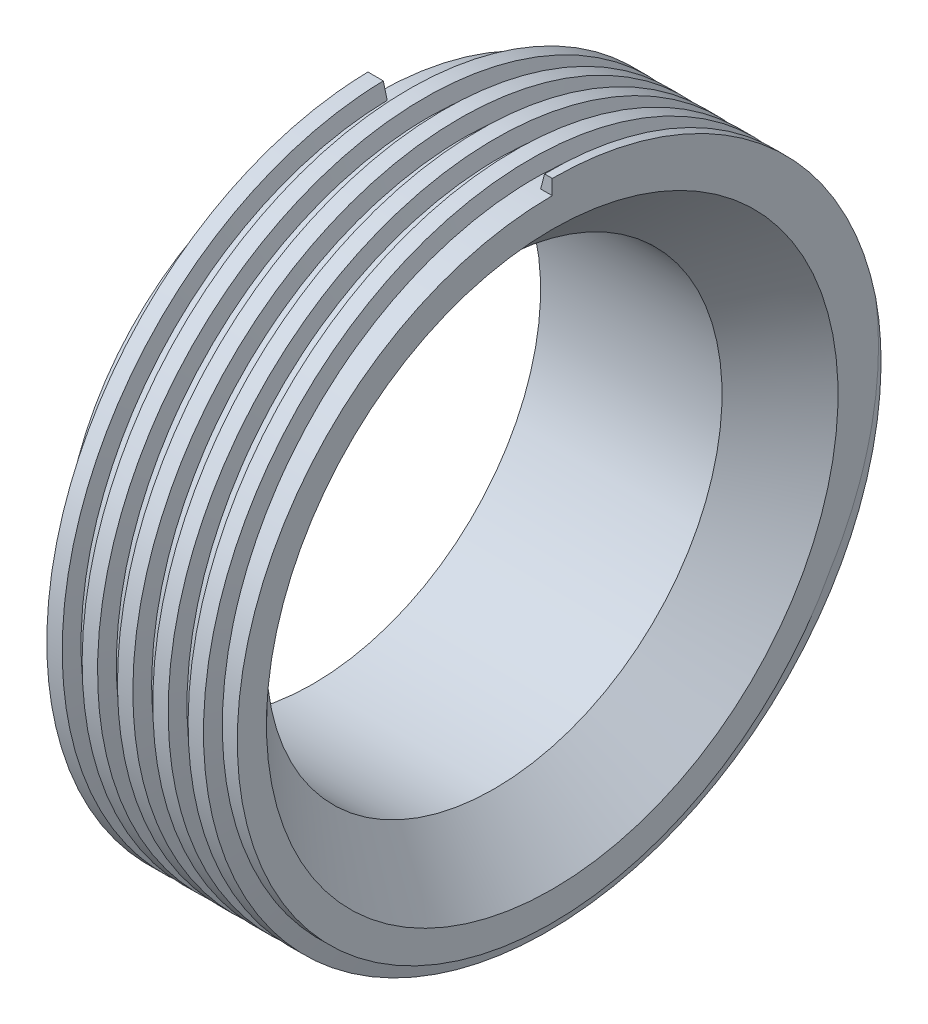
from build123d import *

# Parameters (mm, degrees)
SKETCH10_OUTSIDE_W  = 67.11
SKETCH10_OUTSIDE_H  = 67.11
SKETCH10_OUTSIDE_R  = 24.0538
CUT_EXTRUDE14_DEPTH = 13.4874
SWEEP1_PITCH        = 2.69748
SWEEP1_HEIGHT       = 13.4874
SWEEP1_RADIUS       = 25.1968
SWEEP1_START_ANGLE  = -90
SKETCH15_W          = 9.69456321
SKETCH15_H          = 51.675114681
CUT_EXTRUDE15_DEPTH = 25.4
SKETCH16_R          = 17.399
CUT_EXTRUDE16_DEPTH = 41.052274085
CHAMFER1_SIZE       = 4.42976


with BuildPart() as part:
    # Sketch1 → Revolve1 (revolve)
    with BuildSketch(Plane.XY):
        with BuildLine():
            Line((0, 0), (0, 19.05))
            Line((0, 19.05), (1.6256, 19.05))
            ThreePointArc((1.6256, 19.05), (3.87066403, 19.97993597), (4.8006, 22.225))
            Line((4.8006, 22.225), (4.8006, 25.1968))
            Line((4.8006, 25.1968), (18.288, 25.1968))
            Line((18.288, 25.1968), (18.288, 0))
            Line((18.288, 0), (0, 0))
        make_face()
    revolve(axis=Axis((18.288, 0, 0), (-1, 0, 0)))

    # Sketch10 outside → Cut-Extrude14 (cut)
    with BuildSketch(Plane(origin=(18.288, 0, 0), x_dir=(0, 0, -1), z_dir=(1, 0, 0))):
        Rectangle(SKETCH10_OUTSIDE_W, SKETCH10_OUTSIDE_H)
        with Locations(Location((0, 0, 0), (0, 0, 90))):
            Circle(SKETCH10_OUTSIDE_R, mode=Mode.SUBTRACT)
    extrude(amount=-CUT_EXTRUDE14_DEPTH, mode=Mode.SUBTRACT)

    # Sweep1: sweep along a helix
    with BuildLine() as sweep1_path:
        add(Helix(SWEEP1_PITCH, SWEEP1_HEIGHT, SWEEP1_RADIUS, center=(18.288, 0, 0), direction=(-1, 0, 0), mode=Mode.PRIVATE).rotate(Axis((18.288, 0, 0), (-1, 0, 0)), SWEEP1_START_ANGLE))
    # Sketch13 → Sweep1 (sweep)
    with BuildSketch(Plane(origin=(0, 0, 0), x_dir=(1, 0, 0), z_dir=(0, 1, 0))):
        Polygon((14.328140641, 25.196558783), (15.504160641, 25.196558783), (15.980404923, 23.355058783), (13.851896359, 23.355058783), align=None)
    sweep(path=sweep1_path.line, is_frenet=True)

    # Sketch15 → Cut-Extrude15 (cut)
    with BuildSketch(Plane.XY):
        with Locations((23.135281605, 1.78375734)):
            Rectangle(SKETCH15_W, SKETCH15_H)
    extrude(amount=-CUT_EXTRUDE15_DEPTH, mode=Mode.SUBTRACT)

    # Sketch16 → Cut-Extrude16 (cut, through all)
    with BuildSketch(Plane.ZY):
        with Locations(Location((0, 0, 0), (0, 0, 270))):
            Circle(SKETCH16_R)
    extrude(amount=-CUT_EXTRUDE16_DEPTH, mode=Mode.SUBTRACT)

    # Chamfer1
    chamfer1_edges = [part.edges().sort_by_distance(p)[0] for p in [
        (18.288, 17.399, 0),
    ]]
    chamfer(chamfer1_edges, length=CHAMFER1_SIZE)


solid = part.part
